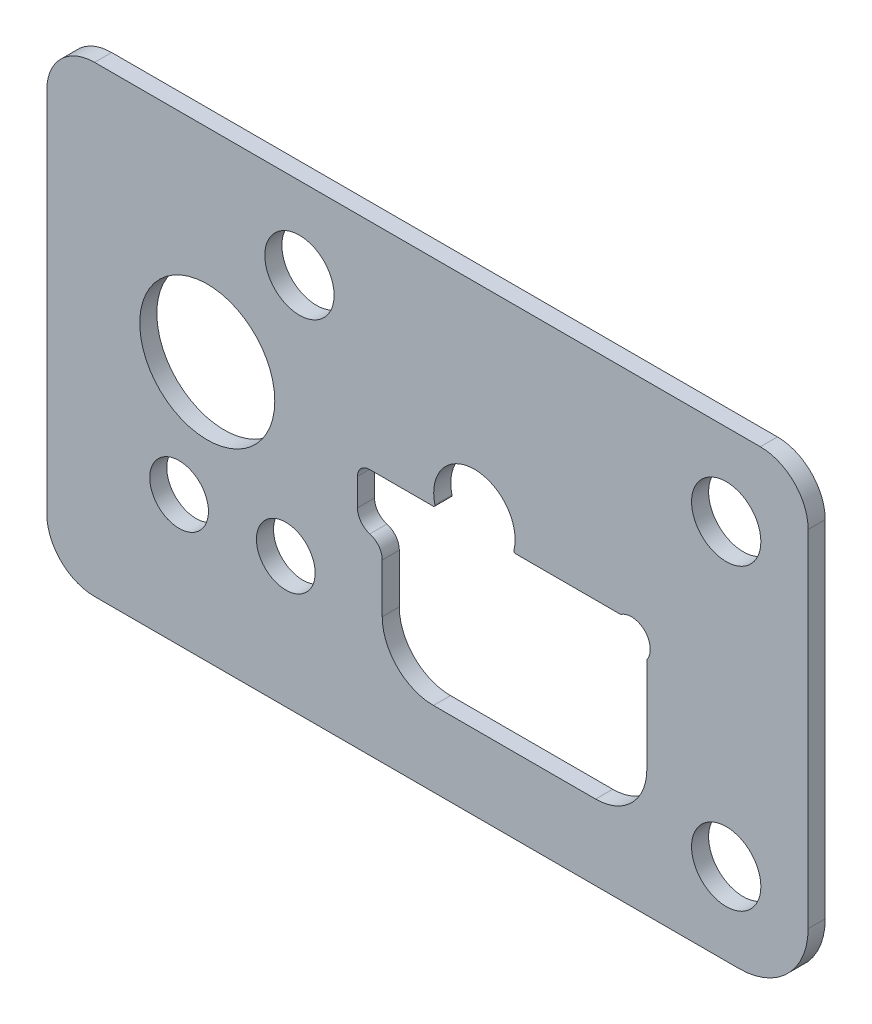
ISO-10303-21;
HEADER;
FILE_DESCRIPTION(('STEP AP214'),'2;1');
FILE_NAME('part.step','',(''),(''),'','','');
FILE_SCHEMA(('AUTOMOTIVE_DESIGN { 1 0 10303 214 1 1 1 1 }'));
ENDSEC;
DATA;
#1=APPLICATION_CONTEXT('core data for automotive mechanical design processes');
#2=APPLICATION_PROTOCOL_DEFINITION('international standard','automotive_design',2000,#1);
#3=PRODUCT_CONTEXT('',#1,'mechanical');
#4=PRODUCT('Part','Part','',(#3));
#5=PRODUCT_RELATED_PRODUCT_CATEGORY('part','',(#4));
#6=PRODUCT_DEFINITION_FORMATION('','',#4);
#7=PRODUCT_DEFINITION_CONTEXT('part definition',#1,'design');
#8=PRODUCT_DEFINITION('design','',#6,#7);
#9=PRODUCT_DEFINITION_SHAPE('','',#8);
#10=(LENGTH_UNIT() NAMED_UNIT(*) SI_UNIT(.MILLI.,.METRE.));
#11=(NAMED_UNIT(*) PLANE_ANGLE_UNIT() SI_UNIT($,.RADIAN.));
#12=(NAMED_UNIT(*) SI_UNIT($,.STERADIAN.) SOLID_ANGLE_UNIT());
#13=UNCERTAINTY_MEASURE_WITH_UNIT(LENGTH_MEASURE(1.E-05),#10,'distance_accuracy_value','');
#14=(GEOMETRIC_REPRESENTATION_CONTEXT(3) GLOBAL_UNCERTAINTY_ASSIGNED_CONTEXT((#13)) GLOBAL_UNIT_ASSIGNED_CONTEXT((#10,
#11,#12)) REPRESENTATION_CONTEXT('',''));
#15=CARTESIAN_POINT('',(0.,0.,0.));
#16=DIRECTION('',(0.,0.,1.));
#17=DIRECTION('',(1.,0.,0.));
#18=AXIS2_PLACEMENT_3D('',#15,#16,#17);
#19=CARTESIAN_POINT('',(-157.226,-88.8003363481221,-31.75));
#20=DIRECTION('',(-1.,0.,0.));
#21=DIRECTION('',(0.,0.,1.));
#22=AXIS2_PLACEMENT_3D('',#19,#20,#21);
#23=PLANE('',#22);
#24=DIRECTION('',(0.,0.,1.));
#25=VECTOR('',#24,1.);
#26=CARTESIAN_POINT('',(-157.226,-90.85930447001,-31.75));
#27=LINE('',#26,#25);
#28=CARTESIAN_POINT('',(-157.226,-90.85930447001,-31.75));
#29=VERTEX_POINT('',#28);
#30=CARTESIAN_POINT('',(-157.226,-90.85930447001,-29.21));
#31=VERTEX_POINT('',#30);
#32=EDGE_CURVE('E242',#29,#31,#27,.T.);
#33=ORIENTED_EDGE('',*,*,#32,.T.);
#34=DIRECTION('',(0.,-1.,0.));
#35=VECTOR('',#34,1.);
#36=CARTESIAN_POINT('',(-157.226,-88.8003363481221,-29.21));
#37=LINE('',#36,#35);
#38=CARTESIAN_POINT('',(-157.226,-98.171,-29.21));
#39=VERTEX_POINT('',#38);
#40=EDGE_CURVE('E305',#31,#39,#37,.T.);
#41=ORIENTED_EDGE('',*,*,#40,.T.);
#42=DIRECTION('',(0.,0.,1.));
#43=VECTOR('',#42,1.);
#44=CARTESIAN_POINT('',(-157.226,-98.171,-31.75));
#45=LINE('',#44,#43);
#46=CARTESIAN_POINT('',(-157.226,-98.171,-31.75));
#47=VERTEX_POINT('',#46);
#48=EDGE_CURVE('E337',#47,#39,#45,.T.);
#49=ORIENTED_EDGE('',*,*,#48,.F.);
#50=DIRECTION('',(0.,-1.,0.));
#51=VECTOR('',#50,1.);
#52=CARTESIAN_POINT('',(-157.226,-88.8003363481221,-31.75));
#53=LINE('',#52,#51);
#54=EDGE_CURVE('E265',#29,#47,#53,.T.);
#55=ORIENTED_EDGE('',*,*,#54,.F.);
#56=EDGE_LOOP('',(#33,#41,#49,#55));
#57=FACE_BOUND('',#56,.T.);
#58=ADVANCED_FACE('F43',(#57),#23,.F.);
#59=CARTESIAN_POINT('',(-100.965,-55.245,-31.75));
#60=DIRECTION('',(0.,0.,1.));
#61=DIRECTION('',(1.,0.,0.));
#62=AXIS2_PLACEMENT_3D('',#59,#60,#61);
#63=CYLINDRICAL_SURFACE('',#62,7.11200000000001);
#64=CARTESIAN_POINT('',(-100.965,-55.245,-29.21));
#65=DIRECTION('',(0.,0.,1.));
#66=DIRECTION('',(1.,0.,0.));
#67=AXIS2_PLACEMENT_3D('',#64,#65,#66);
#68=CIRCLE('',#67,7.11200000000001);
#69=CARTESIAN_POINT('',(-93.853,-55.245,-29.21));
#70=VERTEX_POINT('',#69);
#71=CARTESIAN_POINT('',(-100.965,-48.133,-29.21));
#72=VERTEX_POINT('',#71);
#73=EDGE_CURVE('E387',#70,#72,#68,.T.);
#74=ORIENTED_EDGE('',*,*,#73,.F.);
#75=DIRECTION('',(0.,0.,1.));
#76=VECTOR('',#75,1.);
#77=CARTESIAN_POINT('',(-93.853,-55.245,-31.75));
#78=LINE('',#77,#76);
#79=CARTESIAN_POINT('',(-93.853,-55.245,-31.75));
#80=VERTEX_POINT('',#79);
#81=EDGE_CURVE('E11',#80,#70,#78,.T.);
#82=ORIENTED_EDGE('',*,*,#81,.F.);
#83=CARTESIAN_POINT('',(-100.965,-55.245,-31.75));
#84=DIRECTION('',(0.,0.,1.));
#85=DIRECTION('',(1.,0.,0.));
#86=AXIS2_PLACEMENT_3D('',#83,#84,#85);
#87=CIRCLE('',#86,7.11200000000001);
#88=CARTESIAN_POINT('',(-100.965,-48.133,-31.75));
#89=VERTEX_POINT('',#88);
#90=EDGE_CURVE('E388',#80,#89,#87,.T.);
#91=ORIENTED_EDGE('',*,*,#90,.T.);
#92=DIRECTION('',(0.,0.,1.));
#93=VECTOR('',#92,1.);
#94=CARTESIAN_POINT('',(-100.965,-48.133,-31.75));
#95=LINE('',#94,#93);
#96=EDGE_CURVE('E47',#89,#72,#95,.T.);
#97=ORIENTED_EDGE('',*,*,#96,.T.);
#98=EDGE_LOOP('',(#74,#82,#91,#97));
#99=FACE_BOUND('',#98,.T.);
#100=ADVANCED_FACE('F45',(#99),#63,.T.);
#101=CARTESIAN_POINT('',(-93.853,-106.68,-31.75));
#102=DIRECTION('',(1.,0.,0.));
#103=DIRECTION('',(0.,1.,0.));
#104=AXIS2_PLACEMENT_3D('',#101,#102,#103);
#105=PLANE('',#104);
#106=DIRECTION('',(0.,1.,0.));
#107=VECTOR('',#106,1.);
#108=CARTESIAN_POINT('',(-93.853,-106.68,-29.21));
#109=LINE('',#108,#107);
#110=CARTESIAN_POINT('',(-93.853,-106.68,-29.21));
#111=VERTEX_POINT('',#110);
#112=EDGE_CURVE('E392',#111,#70,#109,.T.);
#113=ORIENTED_EDGE('',*,*,#112,.F.);
#114=DIRECTION('',(0.,0.,1.));
#115=VECTOR('',#114,1.);
#116=CARTESIAN_POINT('',(-93.853,-106.68,-31.75));
#117=LINE('',#116,#115);
#118=CARTESIAN_POINT('',(-93.853,-106.68,-31.75));
#119=VERTEX_POINT('',#118);
#120=EDGE_CURVE('E52',#119,#111,#117,.T.);
#121=ORIENTED_EDGE('',*,*,#120,.F.);
#122=DIRECTION('',(0.,1.,0.));
#123=VECTOR('',#122,1.);
#124=CARTESIAN_POINT('',(-93.853,-106.68,-31.75));
#125=LINE('',#124,#123);
#126=EDGE_CURVE('E410',#119,#80,#125,.T.);
#127=ORIENTED_EDGE('',*,*,#126,.T.);
#128=ORIENTED_EDGE('',*,*,#81,.T.);
#129=EDGE_LOOP('',(#113,#121,#127,#128));
#130=FACE_BOUND('',#129,.T.);
#131=ADVANCED_FACE('F457',(#130),#105,.T.);
#132=CARTESIAN_POINT('',(-104.14,-106.68,-31.75));
#133=DIRECTION('',(0.,0.,1.));
#134=DIRECTION('',(1.,0.,0.));
#135=AXIS2_PLACEMENT_3D('',#132,#133,#134);
#136=CYLINDRICAL_SURFACE('',#135,10.287);
#137=CARTESIAN_POINT('',(-104.14,-106.68,-29.21));
#138=DIRECTION('',(0.,0.,1.));
#139=DIRECTION('',(1.,0.,0.));
#140=AXIS2_PLACEMENT_3D('',#137,#138,#139);
#141=CIRCLE('',#140,10.287);
#142=CARTESIAN_POINT('',(-104.14,-116.967,-29.21));
#143=VERTEX_POINT('',#142);
#144=EDGE_CURVE('E430',#143,#111,#141,.T.);
#145=ORIENTED_EDGE('',*,*,#144,.F.);
#146=DIRECTION('',(0.,0.,1.));
#147=VECTOR('',#146,1.);
#148=CARTESIAN_POINT('',(-104.14,-116.967,-31.75));
#149=LINE('',#148,#147);
#150=CARTESIAN_POINT('',(-104.14,-116.967,-31.75));
#151=VERTEX_POINT('',#150);
#152=EDGE_CURVE('E436',#151,#143,#149,.T.);
#153=ORIENTED_EDGE('',*,*,#152,.F.);
#154=CARTESIAN_POINT('',(-104.14,-106.68,-31.75));
#155=DIRECTION('',(0.,0.,1.));
#156=DIRECTION('',(1.,0.,0.));
#157=AXIS2_PLACEMENT_3D('',#154,#155,#156);
#158=CIRCLE('',#157,10.287);
#159=EDGE_CURVE('E407',#151,#119,#158,.T.);
#160=ORIENTED_EDGE('',*,*,#159,.T.);
#161=ORIENTED_EDGE('',*,*,#120,.T.);
#162=EDGE_LOOP('',(#145,#153,#160,#161));
#163=FACE_BOUND('',#162,.T.);
#164=ADVANCED_FACE('F477',(#163),#136,.T.);
#165=CARTESIAN_POINT('',(-200.025,-116.967,-31.75));
#166=DIRECTION('',(0.,-1.,0.));
#167=DIRECTION('',(0.,0.,-1.));
#168=AXIS2_PLACEMENT_3D('',#165,#166,#167);
#169=PLANE('',#168);
#170=DIRECTION('',(1.,0.,0.));
#171=VECTOR('',#170,1.);
#172=CARTESIAN_POINT('',(-200.025,-116.967,-29.21));
#173=LINE('',#172,#171);
#174=CARTESIAN_POINT('',(-200.025,-116.967,-29.21));
#175=VERTEX_POINT('',#174);
#176=EDGE_CURVE('E427',#175,#143,#173,.T.);
#177=ORIENTED_EDGE('',*,*,#176,.F.);
#178=DIRECTION('',(0.,0.,1.));
#179=VECTOR('',#178,1.);
#180=CARTESIAN_POINT('',(-200.025,-116.967,-31.75));
#181=LINE('',#180,#179);
#182=CARTESIAN_POINT('',(-200.025,-116.967,-31.75));
#183=VERTEX_POINT('',#182);
#184=EDGE_CURVE('E438',#183,#175,#181,.T.);
#185=ORIENTED_EDGE('',*,*,#184,.F.);
#186=DIRECTION('',(1.,0.,0.));
#187=VECTOR('',#186,1.);
#188=CARTESIAN_POINT('',(-200.025,-116.967,-31.75));
#189=LINE('',#188,#187);
#190=EDGE_CURVE('E404',#183,#151,#189,.T.);
#191=ORIENTED_EDGE('',*,*,#190,.T.);
#192=ORIENTED_EDGE('',*,*,#152,.T.);
#193=EDGE_LOOP('',(#177,#185,#191,#192));
#194=FACE_BOUND('',#193,.T.);
#195=ADVANCED_FACE('F475',(#194),#169,.T.);
#196=CARTESIAN_POINT('',(-200.025,-109.855,-31.75));
#197=DIRECTION('',(0.,0.,1.));
#198=DIRECTION('',(1.,0.,0.));
#199=AXIS2_PLACEMENT_3D('',#196,#197,#198);
#200=CYLINDRICAL_SURFACE('',#199,7.11199999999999);
#201=CARTESIAN_POINT('',(-200.025,-109.855,-29.21));
#202=DIRECTION('',(0.,0.,1.));
#203=DIRECTION('',(1.,0.,0.));
#204=AXIS2_PLACEMENT_3D('',#201,#202,#203);
#205=CIRCLE('',#204,7.11199999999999);
#206=CARTESIAN_POINT('',(-207.137,-109.855,-29.21));
#207=VERTEX_POINT('',#206);
#208=EDGE_CURVE('E424',#207,#175,#205,.T.);
#209=ORIENTED_EDGE('',*,*,#208,.F.);
#210=DIRECTION('',(0.,0.,1.));
#211=VECTOR('',#210,1.);
#212=CARTESIAN_POINT('',(-207.137,-109.855,-31.75));
#213=LINE('',#212,#211);
#214=CARTESIAN_POINT('',(-207.137,-109.855,-31.75));
#215=VERTEX_POINT('',#214);
#216=EDGE_CURVE('E440',#215,#207,#213,.T.);
#217=ORIENTED_EDGE('',*,*,#216,.F.);
#218=CARTESIAN_POINT('',(-200.025,-109.855,-31.75));
#219=DIRECTION('',(0.,0.,1.));
#220=DIRECTION('',(1.,0.,0.));
#221=AXIS2_PLACEMENT_3D('',#218,#219,#220);
#222=CIRCLE('',#221,7.11199999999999);
#223=EDGE_CURVE('E401',#215,#183,#222,.T.);
#224=ORIENTED_EDGE('',*,*,#223,.T.);
#225=ORIENTED_EDGE('',*,*,#184,.T.);
#226=EDGE_LOOP('',(#209,#217,#224,#225));
#227=FACE_BOUND('',#226,.T.);
#228=ADVANCED_FACE('F471',(#227),#200,.T.);
#229=CARTESIAN_POINT('',(-207.137,-55.245,-31.75));
#230=DIRECTION('',(-1.,0.,0.));
#231=DIRECTION('',(0.,-1.,0.));
#232=AXIS2_PLACEMENT_3D('',#229,#230,#231);
#233=PLANE('',#232);
#234=DIRECTION('',(0.,-1.,0.));
#235=VECTOR('',#234,1.);
#236=CARTESIAN_POINT('',(-207.137,-55.245,-29.21));
#237=LINE('',#236,#235);
#238=CARTESIAN_POINT('',(-207.137,-55.245,-29.21));
#239=VERTEX_POINT('',#238);
#240=EDGE_CURVE('E421',#239,#207,#237,.T.);
#241=ORIENTED_EDGE('',*,*,#240,.F.);
#242=DIRECTION('',(0.,0.,1.));
#243=VECTOR('',#242,1.);
#244=CARTESIAN_POINT('',(-207.137,-55.245,-31.75));
#245=LINE('',#244,#243);
#246=CARTESIAN_POINT('',(-207.137,-55.245,-31.75));
#247=VERTEX_POINT('',#246);
#248=EDGE_CURVE('E442',#247,#239,#245,.T.);
#249=ORIENTED_EDGE('',*,*,#248,.F.);
#250=DIRECTION('',(0.,-1.,0.));
#251=VECTOR('',#250,1.);
#252=CARTESIAN_POINT('',(-207.137,-55.245,-31.75));
#253=LINE('',#252,#251);
#254=EDGE_CURVE('E398',#247,#215,#253,.T.);
#255=ORIENTED_EDGE('',*,*,#254,.T.);
#256=ORIENTED_EDGE('',*,*,#216,.T.);
#257=EDGE_LOOP('',(#241,#249,#255,#256));
#258=FACE_BOUND('',#257,.T.);
#259=ADVANCED_FACE('F469',(#258),#233,.T.);
#260=CARTESIAN_POINT('',(-200.025,-55.245,-31.75));
#261=DIRECTION('',(0.,0.,1.));
#262=DIRECTION('',(1.,0.,0.));
#263=AXIS2_PLACEMENT_3D('',#260,#261,#262);
#264=CYLINDRICAL_SURFACE('',#263,7.11200000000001);
#265=CARTESIAN_POINT('',(-200.025,-55.245,-29.21));
#266=DIRECTION('',(0.,0.,1.));
#267=DIRECTION('',(1.,0.,0.));
#268=AXIS2_PLACEMENT_3D('',#265,#266,#267);
#269=CIRCLE('',#268,7.11200000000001);
#270=CARTESIAN_POINT('',(-200.025,-48.133,-29.21));
#271=VERTEX_POINT('',#270);
#272=EDGE_CURVE('E418',#271,#239,#269,.T.);
#273=ORIENTED_EDGE('',*,*,#272,.F.);
#274=DIRECTION('',(0.,0.,1.));
#275=VECTOR('',#274,1.);
#276=CARTESIAN_POINT('',(-200.025,-48.133,-31.75));
#277=LINE('',#276,#275);
#278=CARTESIAN_POINT('',(-200.025,-48.133,-31.75));
#279=VERTEX_POINT('',#278);
#280=EDGE_CURVE('E443',#279,#271,#277,.T.);
#281=ORIENTED_EDGE('',*,*,#280,.F.);
#282=CARTESIAN_POINT('',(-200.025,-55.245,-31.75));
#283=DIRECTION('',(0.,0.,1.));
#284=DIRECTION('',(1.,0.,0.));
#285=AXIS2_PLACEMENT_3D('',#282,#283,#284);
#286=CIRCLE('',#285,7.11200000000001);
#287=EDGE_CURVE('E395',#279,#247,#286,.T.);
#288=ORIENTED_EDGE('',*,*,#287,.T.);
#289=ORIENTED_EDGE('',*,*,#248,.T.);
#290=EDGE_LOOP('',(#273,#281,#288,#289));
#291=FACE_BOUND('',#290,.T.);
#292=ADVANCED_FACE('F465',(#291),#264,.T.);
#293=CARTESIAN_POINT('',(-100.965,-48.133,-31.75));
#294=DIRECTION('',(0.,1.,0.));
#295=DIRECTION('',(0.,0.,1.));
#296=AXIS2_PLACEMENT_3D('',#293,#294,#295);
#297=PLANE('',#296);
#298=DIRECTION('',(-1.,0.,0.));
#299=VECTOR('',#298,1.);
#300=CARTESIAN_POINT('',(-100.965,-48.133,-29.21));
#301=LINE('',#300,#299);
#302=EDGE_CURVE('E415',#72,#271,#301,.T.);
#303=ORIENTED_EDGE('',*,*,#302,.F.);
#304=ORIENTED_EDGE('',*,*,#96,.F.);
#305=DIRECTION('',(-1.,0.,0.));
#306=VECTOR('',#305,1.);
#307=CARTESIAN_POINT('',(-100.965,-48.133,-31.75));
#308=LINE('',#307,#306);
#309=EDGE_CURVE('E391',#89,#279,#308,.T.);
#310=ORIENTED_EDGE('',*,*,#309,.T.);
#311=ORIENTED_EDGE('',*,*,#280,.T.);
#312=EDGE_LOOP('',(#303,#304,#310,#311));
#313=FACE_BOUND('',#312,.T.);
#314=ADVANCED_FACE('F451',(#313),#297,.T.);
#315=CARTESIAN_POINT('',(-100.965,-55.245,-31.75));
#316=DIRECTION('',(0.,0.,1.));
#317=DIRECTION('',(1.,0.,0.));
#318=AXIS2_PLACEMENT_3D('',#315,#316,#317);
#319=PLANE('',#318);
#320=CARTESIAN_POINT('',(-158.37154,-85.979,-31.75));
#321=DIRECTION('',(0.,0.,1.));
#322=DIRECTION('',(1.,0.,0.));
#323=AXIS2_PLACEMENT_3D('',#320,#321,#322);
#324=CIRCLE('',#323,2.53745999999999);
#325=CARTESIAN_POINT('',(-160.909,-85.979,-31.75));
#326=VERTEX_POINT('',#325);
#327=CARTESIAN_POINT('',(-159.0675,-88.419152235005,-31.75));
#328=VERTEX_POINT('',#327);
#329=EDGE_CURVE('E221',#326,#328,#324,.T.);
#330=ORIENTED_EDGE('',*,*,#329,.T.);
#331=CARTESIAN_POINT('',(-159.76346,-90.85930447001,-31.75));
#332=DIRECTION('',(0.,0.,-1.));
#333=DIRECTION('',(-1.,0.,0.));
#334=AXIS2_PLACEMENT_3D('',#331,#332,#333);
#335=CIRCLE('',#334,2.53745999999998);
#336=EDGE_CURVE('E226',#328,#29,#335,.T.);
#337=ORIENTED_EDGE('',*,*,#336,.T.);
#338=ORIENTED_EDGE('',*,*,#54,.T.);
#339=CARTESIAN_POINT('',(-149.606,-98.171,-31.75));
#340=DIRECTION('',(0.,0.,1.));
#341=DIRECTION('',(1.,0.,0.));
#342=AXIS2_PLACEMENT_3D('',#339,#340,#341);
#343=CIRCLE('',#342,7.61999999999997);
#344=CARTESIAN_POINT('',(-149.606,-105.791,-31.75));
#345=VERTEX_POINT('',#344);
#346=EDGE_CURVE('E267',#47,#345,#343,.T.);
#347=ORIENTED_EDGE('',*,*,#346,.T.);
#348=DIRECTION('',(1.,0.,0.));
#349=VECTOR('',#348,1.);
#350=CARTESIAN_POINT('',(-149.606,-105.791,-31.75));
#351=LINE('',#350,#349);
#352=CARTESIAN_POINT('',(-125.476,-105.791,-31.75));
#353=VERTEX_POINT('',#352);
#354=EDGE_CURVE('E270',#345,#353,#351,.T.);
#355=ORIENTED_EDGE('',*,*,#354,.T.);
#356=CARTESIAN_POINT('',(-125.476,-98.171,-31.75));
#357=DIRECTION('',(0.,0.,1.));
#358=DIRECTION('',(1.,0.,0.));
#359=AXIS2_PLACEMENT_3D('',#356,#357,#358);
#360=CIRCLE('',#359,7.61999999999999);
#361=CARTESIAN_POINT('',(-117.856,-98.171,-31.75));
#362=VERTEX_POINT('',#361);
#363=EDGE_CURVE('E273',#353,#362,#360,.T.);
#364=ORIENTED_EDGE('',*,*,#363,.T.);
#365=DIRECTION('',(0.,1.,0.));
#366=VECTOR('',#365,1.);
#367=CARTESIAN_POINT('',(-117.856,-98.171,-31.75));
#368=LINE('',#367,#366);
#369=CARTESIAN_POINT('',(-117.856,-84.1078453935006,-31.75));
#370=VERTEX_POINT('',#369);
#371=EDGE_CURVE('E276',#362,#370,#368,.T.);
#372=ORIENTED_EDGE('',*,*,#371,.T.);
#373=CARTESIAN_POINT('',(-117.602,-84.1078453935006,-31.75));
#374=DIRECTION('',(0.,0.,-1.));
#375=DIRECTION('',(1.,0.,0.));
#376=AXIS2_PLACEMENT_3D('',#373,#374,#375);
#377=CIRCLE('',#376,0.254000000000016);
#378=CARTESIAN_POINT('',(-117.813666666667,-83.9674416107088,-31.75));
#379=VERTEX_POINT('',#378);
#380=EDGE_CURVE('E279',#370,#379,#377,.T.);
#381=ORIENTED_EDGE('',*,*,#380,.T.);
#382=CARTESIAN_POINT('',(-120.142,-82.423,-31.75));
#383=DIRECTION('',(0.,0.,1.));
#384=DIRECTION('',(1.,0.,0.));
#385=AXIS2_PLACEMENT_3D('',#382,#383,#384);
#386=CIRCLE('',#385,2.79399999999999);
#387=CARTESIAN_POINT('',(-121.686441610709,-80.0946666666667,-31.75));
#388=VERTEX_POINT('',#387);
#389=EDGE_CURVE('E282',#379,#388,#386,.T.);
#390=ORIENTED_EDGE('',*,*,#389,.T.);
#391=CARTESIAN_POINT('',(-121.826845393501,-79.883,-31.75));
#392=DIRECTION('',(0.,0.,-1.));
#393=DIRECTION('',(1.,0.,0.));
#394=AXIS2_PLACEMENT_3D('',#391,#392,#393);
#395=CIRCLE('',#394,0.254000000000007);
#396=CARTESIAN_POINT('',(-121.826845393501,-80.137,-31.75));
#397=VERTEX_POINT('',#396);
#398=EDGE_CURVE('E248',#388,#397,#395,.T.);
#399=ORIENTED_EDGE('',*,*,#398,.T.);
#400=DIRECTION('',(-1.,0.,0.));
#401=VECTOR('',#400,1.);
#402=CARTESIAN_POINT('',(-121.826845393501,-80.137,-31.75));
#403=LINE('',#402,#401);
#404=CARTESIAN_POINT('',(-137.38484648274,-80.137,-31.75));
#405=VERTEX_POINT('',#404);
#406=EDGE_CURVE('E251',#397,#405,#403,.T.);
#407=ORIENTED_EDGE('',*,*,#406,.T.);
#408=CARTESIAN_POINT('',(-137.38484648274,-79.883,-31.75));
#409=DIRECTION('',(0.,0.,-1.));
#410=DIRECTION('',(1.,0.,0.));
#411=AXIS2_PLACEMENT_3D('',#408,#409,#410);
#412=CIRCLE('',#411,0.254000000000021);
#413=CARTESIAN_POINT('',(-137.631331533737,-79.8216720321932,-31.75));
#414=VERTEX_POINT('',#413);
#415=EDGE_CURVE('E68',#405,#414,#412,.T.);
#416=ORIENTED_EDGE('',*,*,#415,.T.);
#417=CARTESIAN_POINT('',(-143.51,-78.359,-31.75));
#418=DIRECTION('',(0.,0.,1.));
#419=DIRECTION('',(1.,0.,0.));
#420=AXIS2_PLACEMENT_3D('',#417,#418,#419);
#421=CIRCLE('',#420,6.05789999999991);
#422=CARTESIAN_POINT('',(-149.388668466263,-79.8216720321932,-31.75));
#423=VERTEX_POINT('',#422);
#424=EDGE_CURVE('E256',#414,#423,#421,.T.);
#425=ORIENTED_EDGE('',*,*,#424,.T.);
#426=CARTESIAN_POINT('',(-149.63515351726,-79.883,-31.75));
#427=DIRECTION('',(0.,0.,-1.));
#428=DIRECTION('',(1.,0.,0.));
#429=AXIS2_PLACEMENT_3D('',#426,#427,#428);
#430=CIRCLE('',#429,0.254000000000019);
#431=CARTESIAN_POINT('',(-149.63515351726,-80.137,-31.75));
#432=VERTEX_POINT('',#431);
#433=EDGE_CURVE('E259',#423,#432,#430,.T.);
#434=ORIENTED_EDGE('',*,*,#433,.T.);
#435=DIRECTION('',(-1.,0.,0.));
#436=VECTOR('',#435,1.);
#437=CARTESIAN_POINT('',(-149.63515351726,-80.137,-31.75));
#438=LINE('',#437,#436);
#439=CARTESIAN_POINT('',(-159.131,-80.137,-31.75));
#440=VERTEX_POINT('',#439);
#441=EDGE_CURVE('E262',#432,#440,#438,.T.);
#442=ORIENTED_EDGE('',*,*,#441,.T.);
#443=CARTESIAN_POINT('',(-159.131,-81.915,-31.75));
#444=DIRECTION('',(0.,0.,1.));
#445=DIRECTION('',(1.,0.,0.));
#446=AXIS2_PLACEMENT_3D('',#443,#444,#445);
#447=CIRCLE('',#446,1.77799999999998);
#448=CARTESIAN_POINT('',(-160.909,-81.915,-31.75));
#449=VERTEX_POINT('',#448);
#450=EDGE_CURVE('E233',#440,#449,#447,.T.);
#451=ORIENTED_EDGE('',*,*,#450,.T.);
#452=DIRECTION('',(0.,-1.,0.));
#453=VECTOR('',#452,1.);
#454=CARTESIAN_POINT('',(-160.909,-81.915,-31.75));
#455=LINE('',#454,#453);
#456=EDGE_CURVE('E60',#449,#326,#455,.T.);
#457=ORIENTED_EDGE('',*,*,#456,.T.);
#458=EDGE_LOOP('',(#330,#337,#338,#347,#355,#364,#372,#381,#390,#399,#407,#416,#425,#434,#442,
#451,#457));
#459=FACE_BOUND('',#458,.T.);
#460=CARTESIAN_POINT('',(-183.261,-78.359,-31.75));
#461=DIRECTION('',(0.,0.,1.));
#462=DIRECTION('',(1.,0.,0.));
#463=AXIS2_PLACEMENT_3D('',#460,#461,#462);
#464=CIRCLE('',#463,10.0457);
#465=CARTESIAN_POINT('',(-173.2153,-78.359,-31.75));
#466=VERTEX_POINT('',#465);
#467=EDGE_CURVE('E352',#466,#466,#464,.T.);
#468=ORIENTED_EDGE('',*,*,#467,.T.);
#469=EDGE_LOOP('',(#468));
#470=FACE_BOUND('',#469,.T.);
#471=CARTESIAN_POINT('',(-187.452,-97.536,-31.75));
#472=DIRECTION('',(0.,0.,1.));
#473=DIRECTION('',(1.,0.,0.));
#474=AXIS2_PLACEMENT_3D('',#471,#472,#473);
#475=CIRCLE('',#474,4.36879999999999);
#476=CARTESIAN_POINT('',(-183.0832,-97.536,-31.75));
#477=VERTEX_POINT('',#476);
#478=EDGE_CURVE('E326',#477,#477,#475,.T.);
#479=ORIENTED_EDGE('',*,*,#478,.T.);
#480=EDGE_LOOP('',(#479));
#481=FACE_BOUND('',#480,.T.);
#482=CARTESIAN_POINT('',(-171.577,-97.536,-31.75));
#483=DIRECTION('',(0.,0.,1.));
#484=DIRECTION('',(1.,0.,0.));
#485=AXIS2_PLACEMENT_3D('',#482,#483,#484);
#486=CIRCLE('',#485,4.36880000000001);
#487=CARTESIAN_POINT('',(-167.2082,-97.536,-31.75));
#488=VERTEX_POINT('',#487);
#489=EDGE_CURVE('E366',#488,#488,#486,.T.);
#490=ORIENTED_EDGE('',*,*,#489,.T.);
#491=EDGE_LOOP('',(#490));
#492=FACE_BOUND('',#491,.T.);
#493=CARTESIAN_POINT('',(-106.045,-60.325,-31.75));
#494=DIRECTION('',(0.,0.,1.));
#495=DIRECTION('',(1.,0.,0.));
#496=AXIS2_PLACEMENT_3D('',#493,#494,#495);
#497=CIRCLE('',#496,5.1562);
#498=CARTESIAN_POINT('',(-100.8888,-60.325,-31.75));
#499=VERTEX_POINT('',#498);
#500=EDGE_CURVE('E372',#499,#499,#497,.T.);
#501=ORIENTED_EDGE('',*,*,#500,.T.);
#502=EDGE_LOOP('',(#501));
#503=FACE_BOUND('',#502,.T.);
#504=CARTESIAN_POINT('',(-106.045,-104.775,-31.75));
#505=DIRECTION('',(0.,0.,1.));
#506=DIRECTION('',(1.,0.,0.));
#507=AXIS2_PLACEMENT_3D('',#504,#505,#506);
#508=CIRCLE('',#507,5.1562);
#509=CARTESIAN_POINT('',(-100.8888,-104.775,-31.75));
#510=VERTEX_POINT('',#509);
#511=EDGE_CURVE('E378',#510,#510,#508,.T.);
#512=ORIENTED_EDGE('',*,*,#511,.T.);
#513=EDGE_LOOP('',(#512));
#514=FACE_BOUND('',#513,.T.);
#515=CARTESIAN_POINT('',(-169.545,-60.325,-31.75));
#516=DIRECTION('',(0.,0.,1.));
#517=DIRECTION('',(1.,0.,0.));
#518=AXIS2_PLACEMENT_3D('',#515,#516,#517);
#519=CIRCLE('',#518,5.1562);
#520=CARTESIAN_POINT('',(-164.3888,-60.325,-31.75));
#521=VERTEX_POINT('',#520);
#522=EDGE_CURVE('E384',#521,#521,#519,.T.);
#523=ORIENTED_EDGE('',*,*,#522,.T.);
#524=EDGE_LOOP('',(#523));
#525=FACE_BOUND('',#524,.T.);
#526=ORIENTED_EDGE('',*,*,#90,.F.);
#527=ORIENTED_EDGE('',*,*,#126,.F.);
#528=ORIENTED_EDGE('',*,*,#159,.F.);
#529=ORIENTED_EDGE('',*,*,#190,.F.);
#530=ORIENTED_EDGE('',*,*,#223,.F.);
#531=ORIENTED_EDGE('',*,*,#254,.F.);
#532=ORIENTED_EDGE('',*,*,#287,.F.);
#533=ORIENTED_EDGE('',*,*,#309,.F.);
#534=EDGE_LOOP('',(#526,#527,#528,#529,#530,#531,#532,#533));
#535=FACE_BOUND('',#534,.T.);
#536=ADVANCED_FACE('F229',(#459,#470,#481,#492,#503,#514,#525,#535),#319,.F.);
#537=CARTESIAN_POINT('',(-100.965,-55.245,-29.21));
#538=DIRECTION('',(0.,0.,1.));
#539=DIRECTION('',(1.,0.,0.));
#540=AXIS2_PLACEMENT_3D('',#537,#538,#539);
#541=PLANE('',#540);
#542=CARTESIAN_POINT('',(-159.76346,-90.85930447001,-29.21));
#543=DIRECTION('',(0.,0.,-1.));
#544=DIRECTION('',(-1.,0.,0.));
#545=AXIS2_PLACEMENT_3D('',#542,#543,#544);
#546=CIRCLE('',#545,2.53745999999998);
#547=CARTESIAN_POINT('',(-159.0675,-88.419152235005,-29.21));
#548=VERTEX_POINT('',#547);
#549=EDGE_CURVE('E234',#548,#31,#546,.T.);
#550=ORIENTED_EDGE('',*,*,#549,.F.);
#551=CARTESIAN_POINT('',(-158.37154,-85.979,-29.21));
#552=DIRECTION('',(0.,0.,1.));
#553=DIRECTION('',(1.,0.,0.));
#554=AXIS2_PLACEMENT_3D('',#551,#552,#553);
#555=CIRCLE('',#554,2.53745999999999);
#556=CARTESIAN_POINT('',(-160.909,-85.979,-29.21));
#557=VERTEX_POINT('',#556);
#558=EDGE_CURVE('E236',#557,#548,#555,.T.);
#559=ORIENTED_EDGE('',*,*,#558,.F.);
#560=DIRECTION('',(0.,-1.,0.));
#561=VECTOR('',#560,1.);
#562=CARTESIAN_POINT('',(-160.909,-81.915,-29.21));
#563=LINE('',#562,#561);
#564=CARTESIAN_POINT('',(-160.909,-81.915,-29.21));
#565=VERTEX_POINT('',#564);
#566=EDGE_CURVE('E213',#565,#557,#563,.T.);
#567=ORIENTED_EDGE('',*,*,#566,.F.);
#568=CARTESIAN_POINT('',(-159.131,-81.915,-29.21));
#569=DIRECTION('',(0.,0.,1.));
#570=DIRECTION('',(1.,0.,0.));
#571=AXIS2_PLACEMENT_3D('',#568,#569,#570);
#572=CIRCLE('',#571,1.77799999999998);
#573=CARTESIAN_POINT('',(-159.131,-80.137,-29.21));
#574=VERTEX_POINT('',#573);
#575=EDGE_CURVE('E302',#574,#565,#572,.T.);
#576=ORIENTED_EDGE('',*,*,#575,.F.);
#577=DIRECTION('',(-1.,0.,0.));
#578=VECTOR('',#577,1.);
#579=CARTESIAN_POINT('',(-149.63515351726,-80.137,-29.21));
#580=LINE('',#579,#578);
#581=CARTESIAN_POINT('',(-149.63515351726,-80.137,-29.21));
#582=VERTEX_POINT('',#581);
#583=EDGE_CURVE('E299',#582,#574,#580,.T.);
#584=ORIENTED_EDGE('',*,*,#583,.F.);
#585=CARTESIAN_POINT('',(-149.63515351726,-79.883,-29.21));
#586=DIRECTION('',(0.,0.,-1.));
#587=DIRECTION('',(1.,0.,0.));
#588=AXIS2_PLACEMENT_3D('',#585,#586,#587);
#589=CIRCLE('',#588,0.254000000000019);
#590=CARTESIAN_POINT('',(-149.388668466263,-79.8216720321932,-29.21));
#591=VERTEX_POINT('',#590);
#592=EDGE_CURVE('E296',#591,#582,#589,.T.);
#593=ORIENTED_EDGE('',*,*,#592,.F.);
#594=CARTESIAN_POINT('',(-143.51,-78.359,-29.21));
#595=DIRECTION('',(0.,0.,1.));
#596=DIRECTION('',(1.,0.,0.));
#597=AXIS2_PLACEMENT_3D('',#594,#595,#596);
#598=CIRCLE('',#597,6.05789999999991);
#599=CARTESIAN_POINT('',(-137.631331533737,-79.8216720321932,-29.21));
#600=VERTEX_POINT('',#599);
#601=EDGE_CURVE('E293',#600,#591,#598,.T.);
#602=ORIENTED_EDGE('',*,*,#601,.F.);
#603=CARTESIAN_POINT('',(-137.38484648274,-79.883,-29.21));
#604=DIRECTION('',(0.,0.,-1.));
#605=DIRECTION('',(1.,0.,0.));
#606=AXIS2_PLACEMENT_3D('',#603,#604,#605);
#607=CIRCLE('',#606,0.254000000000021);
#608=CARTESIAN_POINT('',(-137.38484648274,-80.137,-29.21));
#609=VERTEX_POINT('',#608);
#610=EDGE_CURVE('E290',#609,#600,#607,.T.);
#611=ORIENTED_EDGE('',*,*,#610,.F.);
#612=DIRECTION('',(-1.,0.,0.));
#613=VECTOR('',#612,1.);
#614=CARTESIAN_POINT('',(-121.826845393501,-80.137,-29.21));
#615=LINE('',#614,#613);
#616=CARTESIAN_POINT('',(-121.826845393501,-80.137,-29.21));
#617=VERTEX_POINT('',#616);
#618=EDGE_CURVE('E287',#617,#609,#615,.T.);
#619=ORIENTED_EDGE('',*,*,#618,.F.);
#620=CARTESIAN_POINT('',(-121.826845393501,-79.883,-29.21));
#621=DIRECTION('',(0.,0.,-1.));
#622=DIRECTION('',(1.,0.,0.));
#623=AXIS2_PLACEMENT_3D('',#620,#621,#622);
#624=CIRCLE('',#623,0.254000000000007);
#625=CARTESIAN_POINT('',(-121.686441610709,-80.0946666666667,-29.21));
#626=VERTEX_POINT('',#625);
#627=EDGE_CURVE('E245',#626,#617,#624,.T.);
#628=ORIENTED_EDGE('',*,*,#627,.F.);
#629=CARTESIAN_POINT('',(-120.142,-82.423,-29.21));
#630=DIRECTION('',(0.,0.,1.));
#631=DIRECTION('',(1.,0.,0.));
#632=AXIS2_PLACEMENT_3D('',#629,#630,#631);
#633=CIRCLE('',#632,2.79399999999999);
#634=CARTESIAN_POINT('',(-117.813666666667,-83.9674416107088,-29.21));
#635=VERTEX_POINT('',#634);
#636=EDGE_CURVE('E252',#635,#626,#633,.T.);
#637=ORIENTED_EDGE('',*,*,#636,.F.);
#638=CARTESIAN_POINT('',(-117.602,-84.1078453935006,-29.21));
#639=DIRECTION('',(0.,0.,-1.));
#640=DIRECTION('',(1.,0.,0.));
#641=AXIS2_PLACEMENT_3D('',#638,#639,#640);
#642=CIRCLE('',#641,0.254000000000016);
#643=CARTESIAN_POINT('',(-117.856,-84.1078453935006,-29.21));
#644=VERTEX_POINT('',#643);
#645=EDGE_CURVE('E319',#644,#635,#642,.T.);
#646=ORIENTED_EDGE('',*,*,#645,.F.);
#647=DIRECTION('',(0.,1.,0.));
#648=VECTOR('',#647,1.);
#649=CARTESIAN_POINT('',(-117.856,-98.171,-29.21));
#650=LINE('',#649,#648);
#651=CARTESIAN_POINT('',(-117.856,-98.171,-29.21));
#652=VERTEX_POINT('',#651);
#653=EDGE_CURVE('E316',#652,#644,#650,.T.);
#654=ORIENTED_EDGE('',*,*,#653,.F.);
#655=CARTESIAN_POINT('',(-125.476,-98.171,-29.21));
#656=DIRECTION('',(0.,0.,1.));
#657=DIRECTION('',(1.,0.,0.));
#658=AXIS2_PLACEMENT_3D('',#655,#656,#657);
#659=CIRCLE('',#658,7.61999999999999);
#660=CARTESIAN_POINT('',(-125.476,-105.791,-29.21));
#661=VERTEX_POINT('',#660);
#662=EDGE_CURVE('E313',#661,#652,#659,.T.);
#663=ORIENTED_EDGE('',*,*,#662,.F.);
#664=DIRECTION('',(1.,0.,0.));
#665=VECTOR('',#664,1.);
#666=CARTESIAN_POINT('',(-149.606,-105.791,-29.21));
#667=LINE('',#666,#665);
#668=CARTESIAN_POINT('',(-149.606,-105.791,-29.21));
#669=VERTEX_POINT('',#668);
#670=EDGE_CURVE('E310',#669,#661,#667,.T.);
#671=ORIENTED_EDGE('',*,*,#670,.F.);
#672=CARTESIAN_POINT('',(-149.606,-98.171,-29.21));
#673=DIRECTION('',(0.,0.,1.));
#674=DIRECTION('',(1.,0.,0.));
#675=AXIS2_PLACEMENT_3D('',#672,#673,#674);
#676=CIRCLE('',#675,7.61999999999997);
#677=EDGE_CURVE('E307',#39,#669,#676,.T.);
#678=ORIENTED_EDGE('',*,*,#677,.F.);
#679=ORIENTED_EDGE('',*,*,#40,.F.);
#680=EDGE_LOOP('',(#550,#559,#567,#576,#584,#593,#602,#611,#619,#628,#637,#646,#654,#663,#671,
#678,#679));
#681=FACE_BOUND('',#680,.T.);
#682=CARTESIAN_POINT('',(-183.261,-78.359,-29.21));
#683=DIRECTION('',(0.,0.,1.));
#684=DIRECTION('',(1.,0.,0.));
#685=AXIS2_PLACEMENT_3D('',#682,#683,#684);
#686=CIRCLE('',#685,10.0457);
#687=CARTESIAN_POINT('',(-173.2153,-78.359,-29.21));
#688=VERTEX_POINT('',#687);
#689=EDGE_CURVE('E356',#688,#688,#686,.T.);
#690=ORIENTED_EDGE('',*,*,#689,.F.);
#691=EDGE_LOOP('',(#690));
#692=FACE_BOUND('',#691,.T.);
#693=CARTESIAN_POINT('',(-187.452,-97.536,-29.21));
#694=DIRECTION('',(0.,0.,1.));
#695=DIRECTION('',(1.,0.,0.));
#696=AXIS2_PLACEMENT_3D('',#693,#694,#695);
#697=CIRCLE('',#696,4.36879999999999);
#698=CARTESIAN_POINT('',(-183.0832,-97.536,-29.21));
#699=VERTEX_POINT('',#698);
#700=EDGE_CURVE('E359',#699,#699,#697,.T.);
#701=ORIENTED_EDGE('',*,*,#700,.F.);
#702=EDGE_LOOP('',(#701));
#703=FACE_BOUND('',#702,.T.);
#704=CARTESIAN_POINT('',(-171.577,-97.536,-29.21));
#705=DIRECTION('',(0.,0.,1.));
#706=DIRECTION('',(1.,0.,0.));
#707=AXIS2_PLACEMENT_3D('',#704,#705,#706);
#708=CIRCLE('',#707,4.36880000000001);
#709=CARTESIAN_POINT('',(-167.2082,-97.536,-29.21));
#710=VERTEX_POINT('',#709);
#711=EDGE_CURVE('E355',#710,#710,#708,.T.);
#712=ORIENTED_EDGE('',*,*,#711,.F.);
#713=EDGE_LOOP('',(#712));
#714=FACE_BOUND('',#713,.T.);
#715=CARTESIAN_POINT('',(-106.045,-60.325,-29.21));
#716=DIRECTION('',(0.,0.,1.));
#717=DIRECTION('',(1.,0.,0.));
#718=AXIS2_PLACEMENT_3D('',#715,#716,#717);
#719=CIRCLE('',#718,5.1562);
#720=CARTESIAN_POINT('',(-100.8888,-60.325,-29.21));
#721=VERTEX_POINT('',#720);
#722=EDGE_CURVE('E369',#721,#721,#719,.T.);
#723=ORIENTED_EDGE('',*,*,#722,.F.);
#724=EDGE_LOOP('',(#723));
#725=FACE_BOUND('',#724,.T.);
#726=CARTESIAN_POINT('',(-106.045,-104.775,-29.21));
#727=DIRECTION('',(0.,0.,1.));
#728=DIRECTION('',(1.,0.,0.));
#729=AXIS2_PLACEMENT_3D('',#726,#727,#728);
#730=CIRCLE('',#729,5.1562);
#731=CARTESIAN_POINT('',(-100.8888,-104.775,-29.21));
#732=VERTEX_POINT('',#731);
#733=EDGE_CURVE('E375',#732,#732,#730,.T.);
#734=ORIENTED_EDGE('',*,*,#733,.F.);
#735=EDGE_LOOP('',(#734));
#736=FACE_BOUND('',#735,.T.);
#737=CARTESIAN_POINT('',(-169.545,-60.325,-29.21));
#738=DIRECTION('',(0.,0.,1.));
#739=DIRECTION('',(1.,0.,0.));
#740=AXIS2_PLACEMENT_3D('',#737,#738,#739);
#741=CIRCLE('',#740,5.1562);
#742=CARTESIAN_POINT('',(-164.3888,-60.325,-29.21));
#743=VERTEX_POINT('',#742);
#744=EDGE_CURVE('E381',#743,#743,#741,.T.);
#745=ORIENTED_EDGE('',*,*,#744,.F.);
#746=EDGE_LOOP('',(#745));
#747=FACE_BOUND('',#746,.T.);
#748=ORIENTED_EDGE('',*,*,#73,.T.);
#749=ORIENTED_EDGE('',*,*,#302,.T.);
#750=ORIENTED_EDGE('',*,*,#272,.T.);
#751=ORIENTED_EDGE('',*,*,#240,.T.);
#752=ORIENTED_EDGE('',*,*,#208,.T.);
#753=ORIENTED_EDGE('',*,*,#176,.T.);
#754=ORIENTED_EDGE('',*,*,#144,.T.);
#755=ORIENTED_EDGE('',*,*,#112,.T.);
#756=EDGE_LOOP('',(#748,#749,#750,#751,#752,#753,#754,#755));
#757=FACE_BOUND('',#756,.T.);
#758=ADVANCED_FACE('F453',(#681,#692,#703,#714,#725,#736,#747,#757),#541,.T.);
#759=CARTESIAN_POINT('',(-169.545,-60.325,-29.21));
#760=DIRECTION('',(0.,0.,1.));
#761=DIRECTION('',(1.,0.,0.));
#762=AXIS2_PLACEMENT_3D('',#759,#760,#761);
#763=CYLINDRICAL_SURFACE('',#762,5.1562);
#764=ORIENTED_EDGE('',*,*,#522,.F.);
#765=EDGE_LOOP('',(#764));
#766=FACE_BOUND('',#765,.T.);
#767=ORIENTED_EDGE('',*,*,#744,.T.);
#768=EDGE_LOOP('',(#767));
#769=FACE_BOUND('',#768,.T.);
#770=ADVANCED_FACE('F545',(#766,#769),#763,.F.);
#771=CARTESIAN_POINT('',(-106.045,-104.775,-29.21));
#772=DIRECTION('',(0.,0.,1.));
#773=DIRECTION('',(1.,0.,0.));
#774=AXIS2_PLACEMENT_3D('',#771,#772,#773);
#775=CYLINDRICAL_SURFACE('',#774,5.1562);
#776=ORIENTED_EDGE('',*,*,#511,.F.);
#777=EDGE_LOOP('',(#776));
#778=FACE_BOUND('',#777,.T.);
#779=ORIENTED_EDGE('',*,*,#733,.T.);
#780=EDGE_LOOP('',(#779));
#781=FACE_BOUND('',#780,.T.);
#782=ADVANCED_FACE('F541',(#778,#781),#775,.F.);
#783=CARTESIAN_POINT('',(-106.045,-60.325,-29.21));
#784=DIRECTION('',(0.,0.,1.));
#785=DIRECTION('',(1.,0.,0.));
#786=AXIS2_PLACEMENT_3D('',#783,#784,#785);
#787=CYLINDRICAL_SURFACE('',#786,5.1562);
#788=ORIENTED_EDGE('',*,*,#500,.F.);
#789=EDGE_LOOP('',(#788));
#790=FACE_BOUND('',#789,.T.);
#791=ORIENTED_EDGE('',*,*,#722,.T.);
#792=EDGE_LOOP('',(#791));
#793=FACE_BOUND('',#792,.T.);
#794=ADVANCED_FACE('F537',(#790,#793),#787,.F.);
#795=CARTESIAN_POINT('',(-171.577,-97.536,-29.21));
#796=DIRECTION('',(0.,0.,1.));
#797=DIRECTION('',(1.,0.,0.));
#798=AXIS2_PLACEMENT_3D('',#795,#796,#797);
#799=CYLINDRICAL_SURFACE('',#798,4.36880000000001);
#800=ORIENTED_EDGE('',*,*,#489,.F.);
#801=EDGE_LOOP('',(#800));
#802=FACE_BOUND('',#801,.T.);
#803=ORIENTED_EDGE('',*,*,#711,.T.);
#804=EDGE_LOOP('',(#803));
#805=FACE_BOUND('',#804,.T.);
#806=ADVANCED_FACE('F533',(#802,#805),#799,.F.);
#807=CARTESIAN_POINT('',(-187.452,-97.536,-31.75));
#808=DIRECTION('',(0.,0.,1.));
#809=DIRECTION('',(1.,0.,0.));
#810=AXIS2_PLACEMENT_3D('',#807,#808,#809);
#811=CYLINDRICAL_SURFACE('',#810,4.36879999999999);
#812=ORIENTED_EDGE('',*,*,#478,.F.);
#813=EDGE_LOOP('',(#812));
#814=FACE_BOUND('',#813,.T.);
#815=ORIENTED_EDGE('',*,*,#700,.T.);
#816=EDGE_LOOP('',(#815));
#817=FACE_BOUND('',#816,.T.);
#818=ADVANCED_FACE('F529',(#814,#817),#811,.F.);
#819=CARTESIAN_POINT('',(-183.261,-78.359,-31.75));
#820=DIRECTION('',(0.,0.,1.));
#821=DIRECTION('',(1.,0.,0.));
#822=AXIS2_PLACEMENT_3D('',#819,#820,#821);
#823=CYLINDRICAL_SURFACE('',#822,10.0457);
#824=ORIENTED_EDGE('',*,*,#467,.F.);
#825=EDGE_LOOP('',(#824));
#826=FACE_BOUND('',#825,.T.);
#827=ORIENTED_EDGE('',*,*,#689,.T.);
#828=EDGE_LOOP('',(#827));
#829=FACE_BOUND('',#828,.T.);
#830=ADVANCED_FACE('F525',(#826,#829),#823,.F.);
#831=CARTESIAN_POINT('',(-121.826845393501,-79.883,-31.75));
#832=DIRECTION('',(0.,0.,1.));
#833=DIRECTION('',(1.,0.,0.));
#834=AXIS2_PLACEMENT_3D('',#831,#832,#833);
#835=CYLINDRICAL_SURFACE('',#834,0.254000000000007);
#836=ORIENTED_EDGE('',*,*,#627,.T.);
#837=DIRECTION('',(0.,0.,1.));
#838=VECTOR('',#837,1.);
#839=CARTESIAN_POINT('',(-121.826845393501,-80.137,-31.75));
#840=LINE('',#839,#838);
#841=EDGE_CURVE('E285',#397,#617,#840,.T.);
#842=ORIENTED_EDGE('',*,*,#841,.F.);
#843=ORIENTED_EDGE('',*,*,#398,.F.);
#844=DIRECTION('',(0.,0.,1.));
#845=VECTOR('',#844,1.);
#846=CARTESIAN_POINT('',(-121.686441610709,-80.0946666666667,-31.75));
#847=LINE('',#846,#845);
#848=EDGE_CURVE('E324',#388,#626,#847,.T.);
#849=ORIENTED_EDGE('',*,*,#848,.T.);
#850=EDGE_LOOP('',(#836,#842,#843,#849));
#851=FACE_BOUND('',#850,.T.);
#852=ADVANCED_FACE('F521',(#851),#835,.T.);
#853=CARTESIAN_POINT('',(-120.142,-82.423,-31.75));
#854=DIRECTION('',(0.,0.,1.));
#855=DIRECTION('',(1.,0.,0.));
#856=AXIS2_PLACEMENT_3D('',#853,#854,#855);
#857=CYLINDRICAL_SURFACE('',#856,2.79399999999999);
#858=ORIENTED_EDGE('',*,*,#636,.T.);
#859=ORIENTED_EDGE('',*,*,#848,.F.);
#860=ORIENTED_EDGE('',*,*,#389,.F.);
#861=DIRECTION('',(0.,0.,1.));
#862=VECTOR('',#861,1.);
#863=CARTESIAN_POINT('',(-117.813666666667,-83.9674416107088,-31.75));
#864=LINE('',#863,#862);
#865=EDGE_CURVE('E327',#379,#635,#864,.T.);
#866=ORIENTED_EDGE('',*,*,#865,.T.);
#867=EDGE_LOOP('',(#858,#859,#860,#866));
#868=FACE_BOUND('',#867,.T.);
#869=ADVANCED_FACE('F524',(#868),#857,.F.);
#870=CARTESIAN_POINT('',(-117.602,-84.1078453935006,-31.75));
#871=DIRECTION('',(0.,0.,1.));
#872=DIRECTION('',(1.,0.,0.));
#873=AXIS2_PLACEMENT_3D('',#870,#871,#872);
#874=CYLINDRICAL_SURFACE('',#873,0.254000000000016);
#875=ORIENTED_EDGE('',*,*,#645,.T.);
#876=ORIENTED_EDGE('',*,*,#865,.F.);
#877=ORIENTED_EDGE('',*,*,#380,.F.);
#878=DIRECTION('',(0.,0.,1.));
#879=VECTOR('',#878,1.);
#880=CARTESIAN_POINT('',(-117.856,-84.1078453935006,-31.75));
#881=LINE('',#880,#879);
#882=EDGE_CURVE('E329',#370,#644,#881,.T.);
#883=ORIENTED_EDGE('',*,*,#882,.T.);
#884=EDGE_LOOP('',(#875,#876,#877,#883));
#885=FACE_BOUND('',#884,.T.);
#886=ADVANCED_FACE('F596',(#885),#874,.T.);
#887=CARTESIAN_POINT('',(-117.856,-98.171,-31.75));
#888=DIRECTION('',(1.,0.,0.));
#889=DIRECTION('',(0.,1.,0.));
#890=AXIS2_PLACEMENT_3D('',#887,#888,#889);
#891=PLANE('',#890);
#892=ORIENTED_EDGE('',*,*,#653,.T.);
#893=ORIENTED_EDGE('',*,*,#882,.F.);
#894=ORIENTED_EDGE('',*,*,#371,.F.);
#895=DIRECTION('',(0.,0.,1.));
#896=VECTOR('',#895,1.);
#897=CARTESIAN_POINT('',(-117.856,-98.171,-31.75));
#898=LINE('',#897,#896);
#899=EDGE_CURVE('E331',#362,#652,#898,.T.);
#900=ORIENTED_EDGE('',*,*,#899,.T.);
#901=EDGE_LOOP('',(#892,#893,#894,#900));
#902=FACE_BOUND('',#901,.T.);
#903=ADVANCED_FACE('F592',(#902),#891,.F.);
#904=CARTESIAN_POINT('',(-125.476,-98.171,-31.75));
#905=DIRECTION('',(0.,0.,1.));
#906=DIRECTION('',(1.,0.,0.));
#907=AXIS2_PLACEMENT_3D('',#904,#905,#906);
#908=CYLINDRICAL_SURFACE('',#907,7.61999999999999);
#909=ORIENTED_EDGE('',*,*,#662,.T.);
#910=ORIENTED_EDGE('',*,*,#899,.F.);
#911=ORIENTED_EDGE('',*,*,#363,.F.);
#912=DIRECTION('',(0.,0.,1.));
#913=VECTOR('',#912,1.);
#914=CARTESIAN_POINT('',(-125.476,-105.791,-31.75));
#915=LINE('',#914,#913);
#916=EDGE_CURVE('E333',#353,#661,#915,.T.);
#917=ORIENTED_EDGE('',*,*,#916,.T.);
#918=EDGE_LOOP('',(#909,#910,#911,#917));
#919=FACE_BOUND('',#918,.T.);
#920=ADVANCED_FACE('F588',(#919),#908,.F.);
#921=CARTESIAN_POINT('',(-149.606,-105.791,-31.75));
#922=DIRECTION('',(0.,-1.,0.));
#923=DIRECTION('',(1.,0.,0.));
#924=AXIS2_PLACEMENT_3D('',#921,#922,#923);
#925=PLANE('',#924);
#926=ORIENTED_EDGE('',*,*,#670,.T.);
#927=ORIENTED_EDGE('',*,*,#916,.F.);
#928=ORIENTED_EDGE('',*,*,#354,.F.);
#929=DIRECTION('',(0.,0.,1.));
#930=VECTOR('',#929,1.);
#931=CARTESIAN_POINT('',(-149.606,-105.791,-31.75));
#932=LINE('',#931,#930);
#933=EDGE_CURVE('E335',#345,#669,#932,.T.);
#934=ORIENTED_EDGE('',*,*,#933,.T.);
#935=EDGE_LOOP('',(#926,#927,#928,#934));
#936=FACE_BOUND('',#935,.T.);
#937=ADVANCED_FACE('F584',(#936),#925,.F.);
#938=CARTESIAN_POINT('',(-149.606,-98.171,-31.75));
#939=DIRECTION('',(0.,0.,1.));
#940=DIRECTION('',(1.,0.,0.));
#941=AXIS2_PLACEMENT_3D('',#938,#939,#940);
#942=CYLINDRICAL_SURFACE('',#941,7.61999999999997);
#943=ORIENTED_EDGE('',*,*,#677,.T.);
#944=ORIENTED_EDGE('',*,*,#933,.F.);
#945=ORIENTED_EDGE('',*,*,#346,.F.);
#946=ORIENTED_EDGE('',*,*,#48,.T.);
#947=EDGE_LOOP('',(#943,#944,#945,#946));
#948=FACE_BOUND('',#947,.T.);
#949=ADVANCED_FACE('F496',(#948),#942,.F.);
#950=CARTESIAN_POINT('',(-159.131,-81.915,-31.75));
#951=DIRECTION('',(0.,0.,1.));
#952=DIRECTION('',(1.,0.,0.));
#953=AXIS2_PLACEMENT_3D('',#950,#951,#952);
#954=CYLINDRICAL_SURFACE('',#953,1.77799999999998);
#955=ORIENTED_EDGE('',*,*,#575,.T.);
#956=DIRECTION('',(0.,0.,1.));
#957=VECTOR('',#956,1.);
#958=CARTESIAN_POINT('',(-160.909,-81.915,-31.75));
#959=LINE('',#958,#957);
#960=EDGE_CURVE('E218',#449,#565,#959,.T.);
#961=ORIENTED_EDGE('',*,*,#960,.F.);
#962=ORIENTED_EDGE('',*,*,#450,.F.);
#963=DIRECTION('',(0.,0.,1.));
#964=VECTOR('',#963,1.);
#965=CARTESIAN_POINT('',(-159.131,-80.137,-31.75));
#966=LINE('',#965,#964);
#967=EDGE_CURVE('E340',#440,#574,#966,.T.);
#968=ORIENTED_EDGE('',*,*,#967,.T.);
#969=EDGE_LOOP('',(#955,#961,#962,#968));
#970=FACE_BOUND('',#969,.T.);
#971=ADVANCED_FACE('F498',(#970),#954,.F.);
#972=CARTESIAN_POINT('',(-149.63515351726,-80.137,-31.75));
#973=DIRECTION('',(0.,1.,0.));
#974=DIRECTION('',(-1.,0.,0.));
#975=AXIS2_PLACEMENT_3D('',#972,#973,#974);
#976=PLANE('',#975);
#977=ORIENTED_EDGE('',*,*,#583,.T.);
#978=ORIENTED_EDGE('',*,*,#967,.F.);
#979=ORIENTED_EDGE('',*,*,#441,.F.);
#980=DIRECTION('',(0.,0.,1.));
#981=VECTOR('',#980,1.);
#982=CARTESIAN_POINT('',(-149.63515351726,-80.137,-31.75));
#983=LINE('',#982,#981);
#984=EDGE_CURVE('E342',#432,#582,#983,.T.);
#985=ORIENTED_EDGE('',*,*,#984,.T.);
#986=EDGE_LOOP('',(#977,#978,#979,#985));
#987=FACE_BOUND('',#986,.T.);
#988=ADVANCED_FACE('F501',(#987),#976,.F.);
#989=CARTESIAN_POINT('',(-149.63515351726,-79.883,-31.75));
#990=DIRECTION('',(0.,0.,1.));
#991=DIRECTION('',(1.,0.,0.));
#992=AXIS2_PLACEMENT_3D('',#989,#990,#991);
#993=CYLINDRICAL_SURFACE('',#992,0.254000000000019);
#994=ORIENTED_EDGE('',*,*,#592,.T.);
#995=ORIENTED_EDGE('',*,*,#984,.F.);
#996=ORIENTED_EDGE('',*,*,#433,.F.);
#997=DIRECTION('',(0.,0.,1.));
#998=VECTOR('',#997,1.);
#999=CARTESIAN_POINT('',(-149.388668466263,-79.8216720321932,-31.75));
#1000=LINE('',#999,#998);
#1001=EDGE_CURVE('E344',#423,#591,#1000,.T.);
#1002=ORIENTED_EDGE('',*,*,#1001,.T.);
#1003=EDGE_LOOP('',(#994,#995,#996,#1002));
#1004=FACE_BOUND('',#1003,.T.);
#1005=ADVANCED_FACE('F505',(#1004),#993,.T.);
#1006=CARTESIAN_POINT('',(-143.51,-78.359,-31.75));
#1007=DIRECTION('',(0.,0.,1.));
#1008=DIRECTION('',(1.,0.,0.));
#1009=AXIS2_PLACEMENT_3D('',#1006,#1007,#1008);
#1010=CYLINDRICAL_SURFACE('',#1009,6.05789999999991);
#1011=ORIENTED_EDGE('',*,*,#601,.T.);
#1012=ORIENTED_EDGE('',*,*,#1001,.F.);
#1013=ORIENTED_EDGE('',*,*,#424,.F.);
#1014=DIRECTION('',(0.,0.,1.));
#1015=VECTOR('',#1014,1.);
#1016=CARTESIAN_POINT('',(-137.631331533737,-79.8216720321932,-31.75));
#1017=LINE('',#1016,#1015);
#1018=EDGE_CURVE('E346',#414,#600,#1017,.T.);
#1019=ORIENTED_EDGE('',*,*,#1018,.T.);
#1020=EDGE_LOOP('',(#1011,#1012,#1013,#1019));
#1021=FACE_BOUND('',#1020,.T.);
#1022=ADVANCED_FACE('F509',(#1021),#1010,.F.);
#1023=CARTESIAN_POINT('',(-137.38484648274,-79.883,-31.75));
#1024=DIRECTION('',(0.,0.,1.));
#1025=DIRECTION('',(1.,0.,0.));
#1026=AXIS2_PLACEMENT_3D('',#1023,#1024,#1025);
#1027=CYLINDRICAL_SURFACE('',#1026,0.254000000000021);
#1028=ORIENTED_EDGE('',*,*,#610,.T.);
#1029=ORIENTED_EDGE('',*,*,#1018,.F.);
#1030=ORIENTED_EDGE('',*,*,#415,.F.);
#1031=DIRECTION('',(0.,0.,1.));
#1032=VECTOR('',#1031,1.);
#1033=CARTESIAN_POINT('',(-137.38484648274,-80.137,-31.75));
#1034=LINE('',#1033,#1032);
#1035=EDGE_CURVE('E348',#405,#609,#1034,.T.);
#1036=ORIENTED_EDGE('',*,*,#1035,.T.);
#1037=EDGE_LOOP('',(#1028,#1029,#1030,#1036));
#1038=FACE_BOUND('',#1037,.T.);
#1039=ADVANCED_FACE('F513',(#1038),#1027,.T.);
#1040=CARTESIAN_POINT('',(-121.826845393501,-80.137,-31.75));
#1041=DIRECTION('',(0.,1.,0.));
#1042=DIRECTION('',(-1.,0.,0.));
#1043=AXIS2_PLACEMENT_3D('',#1040,#1041,#1042);
#1044=PLANE('',#1043);
#1045=ORIENTED_EDGE('',*,*,#618,.T.);
#1046=ORIENTED_EDGE('',*,*,#1035,.F.);
#1047=ORIENTED_EDGE('',*,*,#406,.F.);
#1048=ORIENTED_EDGE('',*,*,#841,.T.);
#1049=EDGE_LOOP('',(#1045,#1046,#1047,#1048));
#1050=FACE_BOUND('',#1049,.T.);
#1051=ADVANCED_FACE('F517',(#1050),#1044,.F.);
#1052=CARTESIAN_POINT('',(-159.76346,-90.85930447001,-31.75));
#1053=DIRECTION('',(0.,0.,1.));
#1054=DIRECTION('',(1.,0.,0.));
#1055=AXIS2_PLACEMENT_3D('',#1052,#1053,#1054);
#1056=CYLINDRICAL_SURFACE('',#1055,2.53745999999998);
#1057=ORIENTED_EDGE('',*,*,#549,.T.);
#1058=ORIENTED_EDGE('',*,*,#32,.F.);
#1059=ORIENTED_EDGE('',*,*,#336,.F.);
#1060=DIRECTION('',(0.,0.,1.));
#1061=VECTOR('',#1060,1.);
#1062=CARTESIAN_POINT('',(-159.0675,-88.419152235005,-31.75));
#1063=LINE('',#1062,#1061);
#1064=EDGE_CURVE('E217',#328,#548,#1063,.T.);
#1065=ORIENTED_EDGE('',*,*,#1064,.T.);
#1066=EDGE_LOOP('',(#1057,#1058,#1059,#1065));
#1067=FACE_BOUND('',#1066,.T.);
#1068=ADVANCED_FACE('F519',(#1067),#1056,.T.);
#1069=CARTESIAN_POINT('',(-158.37154,-85.979,-31.75));
#1070=DIRECTION('',(0.,0.,1.));
#1071=DIRECTION('',(1.,0.,0.));
#1072=AXIS2_PLACEMENT_3D('',#1069,#1070,#1071);
#1073=CYLINDRICAL_SURFACE('',#1072,2.53745999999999);
#1074=ORIENTED_EDGE('',*,*,#558,.T.);
#1075=ORIENTED_EDGE('',*,*,#1064,.F.);
#1076=ORIENTED_EDGE('',*,*,#329,.F.);
#1077=DIRECTION('',(0.,0.,1.));
#1078=VECTOR('',#1077,1.);
#1079=CARTESIAN_POINT('',(-160.909,-85.979,-31.75));
#1080=LINE('',#1079,#1078);
#1081=EDGE_CURVE('E209',#326,#557,#1080,.T.);
#1082=ORIENTED_EDGE('',*,*,#1081,.T.);
#1083=EDGE_LOOP('',(#1074,#1075,#1076,#1082));
#1084=FACE_BOUND('',#1083,.T.);
#1085=ADVANCED_FACE('F222',(#1084),#1073,.F.);
#1086=CARTESIAN_POINT('',(-160.909,-81.915,-31.75));
#1087=DIRECTION('',(-1.,0.,0.));
#1088=DIRECTION('',(0.,0.,1.));
#1089=AXIS2_PLACEMENT_3D('',#1086,#1087,#1088);
#1090=PLANE('',#1089);
#1091=ORIENTED_EDGE('',*,*,#566,.T.);
#1092=ORIENTED_EDGE('',*,*,#1081,.F.);
#1093=ORIENTED_EDGE('',*,*,#456,.F.);
#1094=ORIENTED_EDGE('',*,*,#960,.T.);
#1095=EDGE_LOOP('',(#1091,#1092,#1093,#1094));
#1096=FACE_BOUND('',#1095,.T.);
#1097=ADVANCED_FACE('F211',(#1096),#1090,.F.);
#1098=CLOSED_SHELL('',(#58,#100,#131,#164,#195,#228,#259,#292,#314,#536,#758,#770,#782,#794,
#806,#818,#830,#852,#869,#886,#903,#920,#937,#949,#971,#988,#1005,#1022,#1039,#1051,#1068,#1085,#1097));
#1099=MANIFOLD_SOLID_BREP('B2',#1098);
#1100=ADVANCED_BREP_SHAPE_REPRESENTATION('',(#18,#1099),#14);
#1101=SHAPE_DEFINITION_REPRESENTATION(#9,#1100);
ENDSEC;
END-ISO-10303-21;
